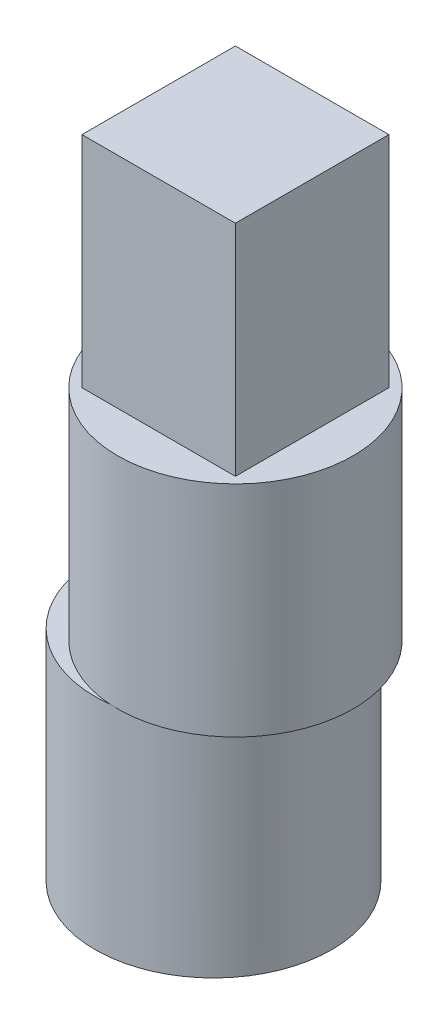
from build123d import *

# Parameters (mm, degrees)
SKIZZE1_R                       = 5.375
AUFSATZ_LINEAR_AUSTRAGEN1_DEPTH = 10
SKIZZE3_R                       = 5.4
AUFSATZ_LINEAR_AUSTRAGEN3_DEPTH = 10
SKIZZE4_W                       = 7
SKIZZE4_H                       = 7
AUFSATZ_LINEAR_AUSTRAGEN4_DEPTH = 10


with BuildPart() as part:
    # Skizze1 → Aufsatz-Linear austragen1 (new body)
    with BuildSketch(Plane(origin=(0, 0, 0), x_dir=(1, 0, 0), z_dir=(0, 1, 0))):
        with Locations(Location((0, 0, 0), (0, 0, 270))):
            Circle(SKIZZE1_R)
    extrude(amount=AUFSATZ_LINEAR_AUSTRAGEN1_DEPTH)

    # Skizze3 → Aufsatz-Linear austragen3 (add)
    with BuildSketch(Plane(origin=(0, 0, 0), x_dir=(-1, 0, 0), z_dir=(0, -1, 0))):
        with Locations(Location((1, 0, 0), (0, 0, 263.25015435))):
            Circle(SKIZZE3_R)
    extrude(amount=AUFSATZ_LINEAR_AUSTRAGEN3_DEPTH)

    # Skizze4 → Aufsatz-Linear austragen4 (add)
    with BuildSketch(Plane(origin=(0, 10, 0), x_dir=(1, 0, 0), z_dir=(0, 1, 0))):
        Rectangle(SKIZZE4_W, SKIZZE4_H)
    extrude(amount=AUFSATZ_LINEAR_AUSTRAGEN4_DEPTH)


solid = part.part
